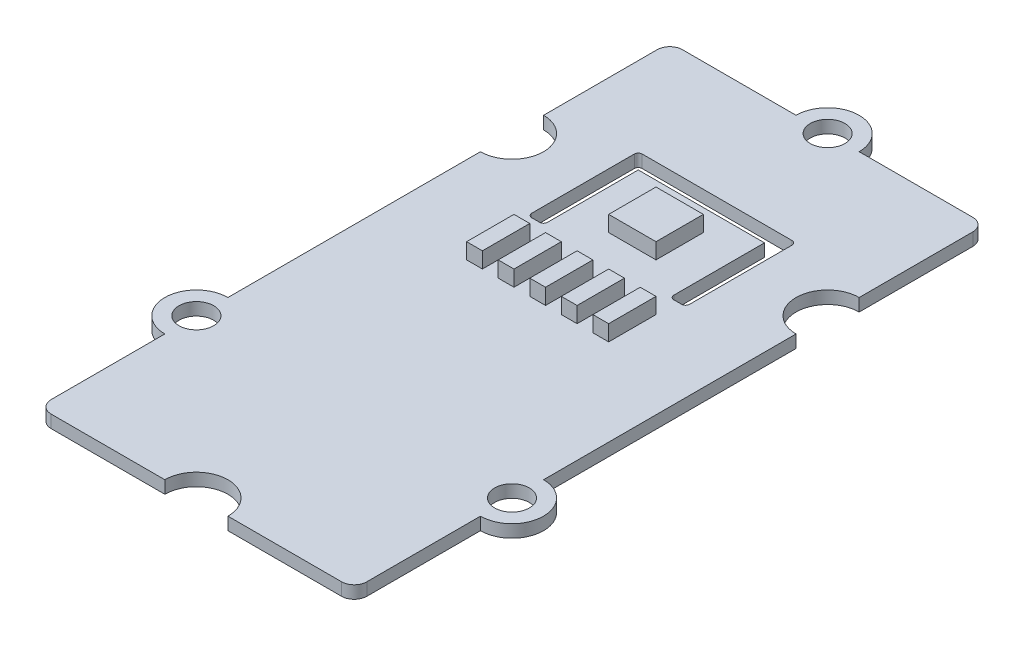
from build123d import *

# Parameters (mm, degrees)
SKETCH1_R        = 1.1
BOARD_DEPTH      = 0.8
U_CUT_DEPTH      = 48.419827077
U_CUT_DEPTH_BACK = 48.419827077
SKETCH3_W        = 1
SKETCH3_H        = 3
SKETCH3_W_2      = 3
SMDS_DEPTH       = 1


with BuildPart() as part:
    # Sketch1 → Board (new body)
    with BuildSketch(Plane(origin=(0, 0, 0), x_dir=(1, 0, 0), z_dir=(0, 1, 0))):
        with BuildLine():
            Line((0.8, 0), (8, 0))
            ThreePointArc((8, 0), (10, 2), (12, 0))
            Line((12, 0), (19.2, 0))
            ThreePointArc((19.2, 0), (19.765685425, 0.234314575), (20, 0.8))
            Line((20, 0.8), (20, 8))
            ThreePointArc((20, 8), (22, 10), (20, 12))
            Line((20, 12), (20, 28))
            ThreePointArc((20, 28), (18, 30), (20, 32))
            Line((20, 32), (20, 39.2))
            ThreePointArc((20, 39.2), (19.765685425, 39.765685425), (19.2, 40))
            Line((19.2, 40), (12, 40))
            ThreePointArc((12, 40), (10, 42), (8, 40))
            Line((8, 40), (0.8, 40))
            ThreePointArc((0.8, 40), (0.234314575, 39.765685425), (0, 39.2))
            Line((0, 39.2), (0, 32))
            ThreePointArc((0, 32), (2, 30), (0, 28))
            Line((0, 28), (0, 12))
            ThreePointArc((0, 12), (-2, 10), (0, 8))
            Line((0, 8), (0, 0.8))
            ThreePointArc((0, 0.8), (0.234314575, 0.234314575), (0.8, 0))
        make_face()
        with Locations(Location((10, 40, 0), (0, 0, 270))):
            Circle(SKETCH1_R, mode=Mode.SUBTRACT)
        with Locations(Location((0, 10, 0), (0, 0, 270))):
            Circle(SKETCH1_R, mode=Mode.SUBTRACT)
        with Locations(Location((20, 10, 0), (0, 0, 270))):
            Circle(SKETCH1_R, mode=Mode.SUBTRACT)
    extrude(amount=BOARD_DEPTH)

    # Sketch2 → U-cut (cut, two sides: drawn at the far end of the back side and taken through both)
    with BuildSketch(Plane(origin=(0, 0.8, 0), x_dir=(1, 0, 0), z_dir=(0, 1, 0)).offset(-U_CUT_DEPTH_BACK)):
        with BuildLine():
            Line((14.25, 26), (14.75, 26))
            ThreePointArc((14.75, 26), (14.926776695, 26.073223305), (15, 26.25))
            Line((15, 26.25), (15, 32.75))
            ThreePointArc((15, 32.75), (14.926776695, 32.926776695), (14.75, 33))
            Line((14.75, 33), (5.25, 33))
            ThreePointArc((5.25, 33), (5.073223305, 32.926776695), (5, 32.75))
            Line((5, 32.75), (5, 26.25))
            ThreePointArc((5, 26.25), (5.073223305, 26.073223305), (5.25, 26))
            Line((5.25, 26), (5.75, 26))
            ThreePointArc((5.75, 26), (5.926776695, 26.073223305), (6, 26.25))
            Line((6, 26.25), (6, 32))
            Line((6, 32), (14, 32))
            Line((14, 32), (14, 26.25))
            ThreePointArc((14, 26.25), (14.073223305, 26.073223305), (14.25, 26))
        make_face()
    extrude(amount=U_CUT_DEPTH + U_CUT_DEPTH_BACK, mode=Mode.SUBTRACT)

    # Sketch3 → SMDs (add)
    with BuildSketch(Plane(origin=(0, 0.8, 0), x_dir=(1, 0, 0), z_dir=(0, 1, 0))):
        with Locations((6, 23.125)):
            Rectangle(SKETCH3_W, SKETCH3_H)
        with Locations((8, 23.125)):
            Rectangle(SKETCH3_W, SKETCH3_H)
        with Locations((10, 23.125)):
            Rectangle(SKETCH3_W, SKETCH3_H)
        with Locations((12, 23.125)):
            Rectangle(SKETCH3_W, SKETCH3_H)
        with Locations((14, 23.125)):
            Rectangle(SKETCH3_W, SKETCH3_H)
        with Locations((10, 29.125)):
            Rectangle(SKETCH3_W_2, SKETCH3_H)
    extrude(amount=SMDS_DEPTH)


solid = part.part
